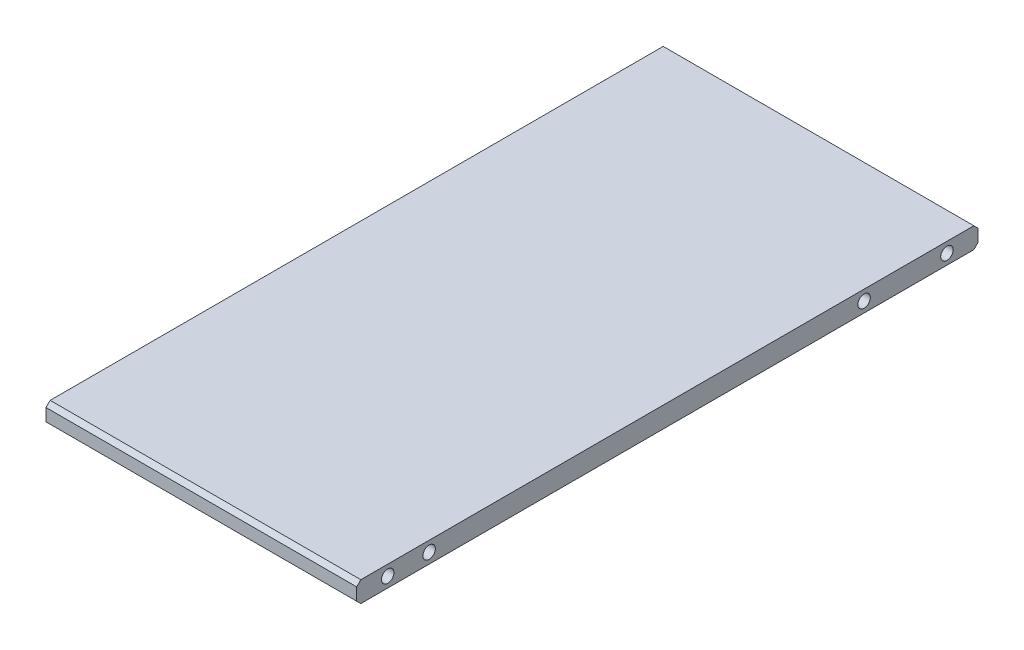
from build123d import *

# Parameters (mm, degrees)
CROQUIS1_W              = 150
CROQUIS1_H              = 300
SALIENTE_EXTRUIR1_DEPTH = 10
CHAFL_N1_SIZE           = 2
CROQUIS8_R              = 3
CORTAR_EXTRUIR1_DEPTH   = 336.574507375


with BuildPart() as part:
    # Croquis1 → Saliente-Extruir1 (new body)
    with BuildSketch(Plane(origin=(0, -0.5, 0), x_dir=(1, 0, 0), z_dir=(0, 1, 0))):
        with Locations((-75, 150)):
            Rectangle(CROQUIS1_W, CROQUIS1_H)
    extrude(amount=-SALIENTE_EXTRUIR1_DEPTH)

    # Chafl_n1
    chafl_n1_edges = [part.edges().sort_by_distance(p)[0] for p in [
        (-75, -10.5, -300),
        (-75, -10.5, 0),
        (-75, -0.5, -300),
        (-75, -0.5, 0),
    ]]
    chamfer(chafl_n1_edges, length=CHAFL_N1_SIZE)

    # Croquis8 → Cortar-Extruir1 (cut, through all)
    with BuildSketch(Plane(origin=(0, 0, 0), x_dir=(0, 0, -1), z_dir=(1, 0, 0))):
        with Locations((15, -5.5)):
            Circle(CROQUIS8_R)
        with Locations((245, -5.5)):
            Circle(CROQUIS8_R)
        with Locations((285, -5.5)):
            Circle(CROQUIS8_R)
        with Locations((35, -5.5)):
            Circle(CROQUIS8_R)
    extrude(amount=-CORTAR_EXTRUIR1_DEPTH, mode=Mode.SUBTRACT)


solid = part.part
